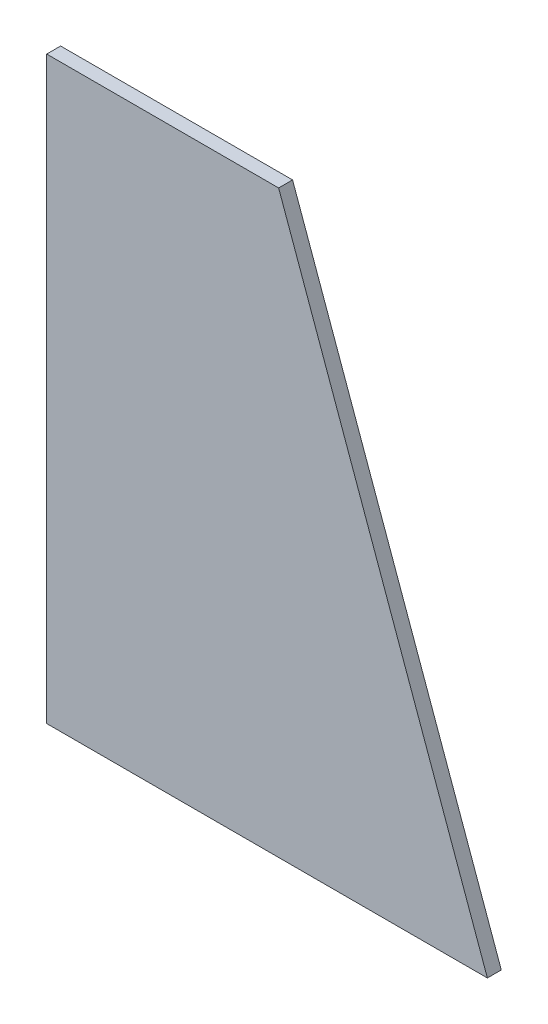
ISO-10303-21;
HEADER;
FILE_DESCRIPTION(('STEP AP214'),'2;1');
FILE_NAME('part.step','',(''),(''),'','','');
FILE_SCHEMA(('AUTOMOTIVE_DESIGN { 1 0 10303 214 1 1 1 1 }'));
ENDSEC;
DATA;
#1=APPLICATION_CONTEXT('core data for automotive mechanical design processes');
#2=APPLICATION_PROTOCOL_DEFINITION('international standard','automotive_design',2000,#1);
#3=PRODUCT_CONTEXT('',#1,'mechanical');
#4=PRODUCT('Part','Part','',(#3));
#5=PRODUCT_RELATED_PRODUCT_CATEGORY('part','',(#4));
#6=PRODUCT_DEFINITION_FORMATION('','',#4);
#7=PRODUCT_DEFINITION_CONTEXT('part definition',#1,'design');
#8=PRODUCT_DEFINITION('design','',#6,#7);
#9=PRODUCT_DEFINITION_SHAPE('','',#8);
#10=(LENGTH_UNIT() NAMED_UNIT(*) SI_UNIT(.MILLI.,.METRE.));
#11=(NAMED_UNIT(*) PLANE_ANGLE_UNIT() SI_UNIT($,.RADIAN.));
#12=(NAMED_UNIT(*) SI_UNIT($,.STERADIAN.) SOLID_ANGLE_UNIT());
#13=UNCERTAINTY_MEASURE_WITH_UNIT(LENGTH_MEASURE(1.E-05),#10,'distance_accuracy_value','');
#14=(GEOMETRIC_REPRESENTATION_CONTEXT(3) GLOBAL_UNCERTAINTY_ASSIGNED_CONTEXT((#13)) GLOBAL_UNIT_ASSIGNED_CONTEXT((#10,
#11,#12)) REPRESENTATION_CONTEXT('',''));
#15=CARTESIAN_POINT('',(0.,0.,0.));
#16=DIRECTION('',(0.,0.,1.));
#17=DIRECTION('',(1.,0.,0.));
#18=AXIS2_PLACEMENT_3D('',#15,#16,#17);
#19=CARTESIAN_POINT('',(0.,250.,6.));
#20=DIRECTION('',(0.,1.,0.));
#21=DIRECTION('',(0.,0.,1.));
#22=AXIS2_PLACEMENT_3D('',#19,#20,#21);
#23=PLANE('',#22);
#24=DIRECTION('',(1.,0.,0.));
#25=VECTOR('',#24,1.);
#26=CARTESIAN_POINT('',(0.,250.,0.));
#27=LINE('',#26,#25);
#28=CARTESIAN_POINT('',(0.,250.,0.));
#29=VERTEX_POINT('',#28);
#30=CARTESIAN_POINT('',(100.,250.,0.));
#31=VERTEX_POINT('',#30);
#32=EDGE_CURVE('E98',#29,#31,#27,.T.);
#33=ORIENTED_EDGE('',*,*,#32,.F.);
#34=DIRECTION('',(0.,0.,-1.));
#35=VECTOR('',#34,1.);
#36=CARTESIAN_POINT('',(0.,250.,6.));
#37=LINE('',#36,#35);
#38=CARTESIAN_POINT('',(0.,250.,6.));
#39=VERTEX_POINT('',#38);
#40=EDGE_CURVE('E11',#39,#29,#37,.T.);
#41=ORIENTED_EDGE('',*,*,#40,.F.);
#42=DIRECTION('',(1.,0.,0.));
#43=VECTOR('',#42,1.);
#44=CARTESIAN_POINT('',(0.,250.,6.));
#45=LINE('',#44,#43);
#46=CARTESIAN_POINT('',(100.,250.,6.));
#47=VERTEX_POINT('',#46);
#48=EDGE_CURVE('E93',#39,#47,#45,.T.);
#49=ORIENTED_EDGE('',*,*,#48,.T.);
#50=DIRECTION('',(0.,0.,-1.));
#51=VECTOR('',#50,1.);
#52=CARTESIAN_POINT('',(100.,250.,6.));
#53=LINE('',#52,#51);
#54=EDGE_CURVE('E36',#47,#31,#53,.T.);
#55=ORIENTED_EDGE('',*,*,#54,.T.);
#56=EDGE_LOOP('',(#33,#41,#49,#55));
#57=FACE_BOUND('',#56,.T.);
#58=ADVANCED_FACE('F33',(#57),#23,.T.);
#59=CARTESIAN_POINT('',(0.,250.,6.));
#60=DIRECTION('',(1.,0.,0.));
#61=DIRECTION('',(0.,1.,0.));
#62=AXIS2_PLACEMENT_3D('',#59,#60,#61);
#63=PLANE('',#62);
#64=DIRECTION('',(0.,-1.,0.));
#65=VECTOR('',#64,1.);
#66=CARTESIAN_POINT('',(0.,250.,0.));
#67=LINE('',#66,#65);
#68=CARTESIAN_POINT('',(0.,0.,0.));
#69=VERTEX_POINT('',#68);
#70=EDGE_CURVE('E66',#29,#69,#67,.T.);
#71=ORIENTED_EDGE('',*,*,#70,.T.);
#72=DIRECTION('',(0.,0.,-1.));
#73=VECTOR('',#72,1.);
#74=CARTESIAN_POINT('',(0.,0.,6.));
#75=LINE('',#74,#73);
#76=CARTESIAN_POINT('',(0.,0.,6.));
#77=VERTEX_POINT('',#76);
#78=EDGE_CURVE('E42',#77,#69,#75,.T.);
#79=ORIENTED_EDGE('',*,*,#78,.F.);
#80=DIRECTION('',(0.,-1.,0.));
#81=VECTOR('',#80,1.);
#82=CARTESIAN_POINT('',(0.,250.,6.));
#83=LINE('',#82,#81);
#84=EDGE_CURVE('E83',#39,#77,#83,.T.);
#85=ORIENTED_EDGE('',*,*,#84,.F.);
#86=ORIENTED_EDGE('',*,*,#40,.T.);
#87=EDGE_LOOP('',(#71,#79,#85,#86));
#88=FACE_BOUND('',#87,.T.);
#89=ADVANCED_FACE('F108',(#88),#63,.F.);
#90=CARTESIAN_POINT('',(0.,0.,6.));
#91=DIRECTION('',(0.,1.,0.));
#92=DIRECTION('',(0.,0.,1.));
#93=AXIS2_PLACEMENT_3D('',#90,#91,#92);
#94=PLANE('',#93);
#95=DIRECTION('',(1.,0.,0.));
#96=VECTOR('',#95,1.);
#97=CARTESIAN_POINT('',(0.,0.,0.));
#98=LINE('',#97,#96);
#99=CARTESIAN_POINT('',(190.,0.,0.));
#100=VERTEX_POINT('',#99);
#101=EDGE_CURVE('E90',#69,#100,#98,.T.);
#102=ORIENTED_EDGE('',*,*,#101,.T.);
#103=DIRECTION('',(0.,0.,-1.));
#104=VECTOR('',#103,1.);
#105=CARTESIAN_POINT('',(190.,0.,6.));
#106=LINE('',#105,#104);
#107=CARTESIAN_POINT('',(190.,0.,6.));
#108=VERTEX_POINT('',#107);
#109=EDGE_CURVE('E87',#108,#100,#106,.T.);
#110=ORIENTED_EDGE('',*,*,#109,.F.);
#111=DIRECTION('',(1.,0.,0.));
#112=VECTOR('',#111,1.);
#113=CARTESIAN_POINT('',(0.,0.,6.));
#114=LINE('',#113,#112);
#115=EDGE_CURVE('E78',#77,#108,#114,.T.);
#116=ORIENTED_EDGE('',*,*,#115,.F.);
#117=ORIENTED_EDGE('',*,*,#78,.T.);
#118=EDGE_LOOP('',(#102,#110,#116,#117));
#119=FACE_BOUND('',#118,.T.);
#120=ADVANCED_FACE('F88',(#119),#94,.F.);
#121=CARTESIAN_POINT('',(100.,250.,6.));
#122=DIRECTION('',(0.940887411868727,0.338719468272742,0.));
#123=DIRECTION('',(-0.338719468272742,0.940887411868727,0.));
#124=AXIS2_PLACEMENT_3D('',#121,#122,#123);
#125=PLANE('',#124);
#126=DIRECTION('',(0.338719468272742,-0.940887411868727,0.));
#127=VECTOR('',#126,1.);
#128=CARTESIAN_POINT('',(100.,250.,0.));
#129=LINE('',#128,#127);
#130=EDGE_CURVE('E101',#31,#100,#129,.T.);
#131=ORIENTED_EDGE('',*,*,#130,.F.);
#132=ORIENTED_EDGE('',*,*,#54,.F.);
#133=DIRECTION('',(0.338719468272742,-0.940887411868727,0.));
#134=VECTOR('',#133,1.);
#135=CARTESIAN_POINT('',(100.,250.,6.));
#136=LINE('',#135,#134);
#137=EDGE_CURVE('E82',#47,#108,#136,.T.);
#138=ORIENTED_EDGE('',*,*,#137,.T.);
#139=ORIENTED_EDGE('',*,*,#109,.T.);
#140=EDGE_LOOP('',(#131,#132,#138,#139));
#141=FACE_BOUND('',#140,.T.);
#142=ADVANCED_FACE('F92',(#141),#125,.T.);
#143=CARTESIAN_POINT('',(0.,0.,6.));
#144=DIRECTION('',(0.,0.,-1.));
#145=DIRECTION('',(-1.,0.,0.));
#146=AXIS2_PLACEMENT_3D('',#143,#144,#145);
#147=PLANE('',#146);
#148=ORIENTED_EDGE('',*,*,#48,.F.);
#149=ORIENTED_EDGE('',*,*,#84,.T.);
#150=ORIENTED_EDGE('',*,*,#115,.T.);
#151=ORIENTED_EDGE('',*,*,#137,.F.);
#152=EDGE_LOOP('',(#148,#149,#150,#151));
#153=FACE_BOUND('',#152,.T.);
#154=ADVANCED_FACE('F81',(#153),#147,.F.);
#155=CARTESIAN_POINT('',(0.,0.,0.));
#156=DIRECTION('',(0.,0.,-1.));
#157=DIRECTION('',(-1.,0.,0.));
#158=AXIS2_PLACEMENT_3D('',#155,#156,#157);
#159=PLANE('',#158);
#160=ORIENTED_EDGE('',*,*,#32,.T.);
#161=ORIENTED_EDGE('',*,*,#130,.T.);
#162=ORIENTED_EDGE('',*,*,#101,.F.);
#163=ORIENTED_EDGE('',*,*,#70,.F.);
#164=EDGE_LOOP('',(#160,#161,#162,#163));
#165=FACE_BOUND('',#164,.T.);
#166=ADVANCED_FACE('F106',(#165),#159,.T.);
#167=CLOSED_SHELL('',(#58,#89,#120,#142,#154,#166));
#168=MANIFOLD_SOLID_BREP('B2',#167);
#169=ADVANCED_BREP_SHAPE_REPRESENTATION('',(#18,#168),#14);
#170=SHAPE_DEFINITION_REPRESENTATION(#9,#169);
ENDSEC;
END-ISO-10303-21;
